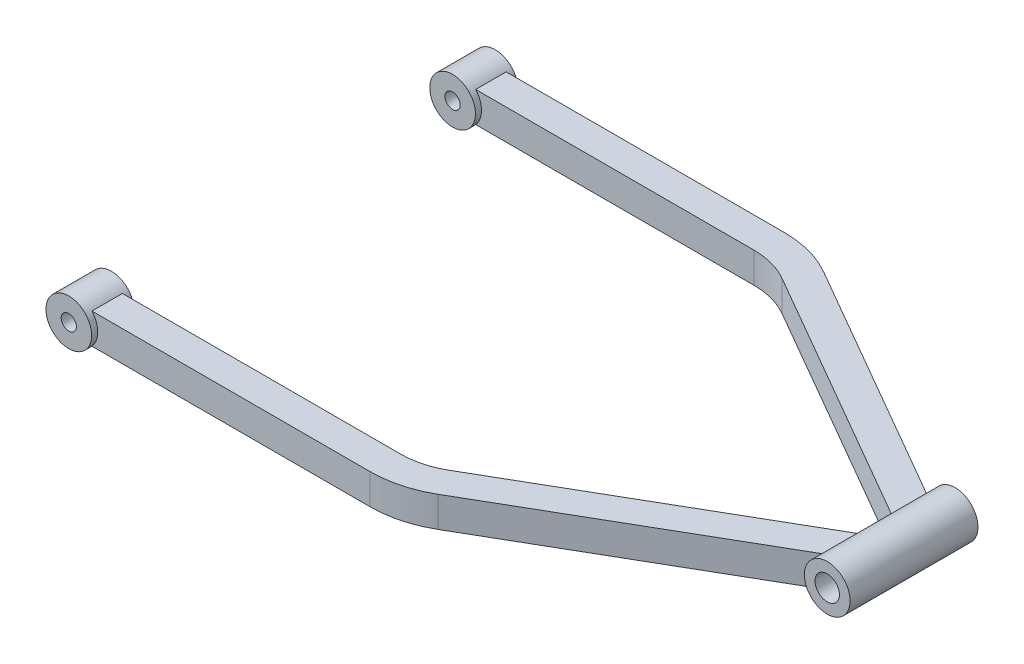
from build123d import *

# Parameters (mm, degrees)
SKETCH2_R               = 7.5
SKETCH2_R_2             = 2.5
BOSS_EXTRUDE1_DEPTH     = 7
SKETCH4_R               = 7.5
SKETCH4_R_2             = 4
BOSS_EXTRUDE2_DEPTH     = 21
SKETCH3_W               = 10
SKETCH3_H               = 10
CUT_EXTRUDE1_DEPTH      = 137
CUT_EXTRUDE1_DEPTH_BACK = 20
SKETCH2_2_R             = 2.5
SKETCH4_2_R             = 4
CUT_EXTRUDE2_DEPTH      = 30


with BuildPart() as part:
    # Sketch2 → Boss-Extrude1 (new, symmetric)
    with BuildSketch(Plane.XY.offset(-63)):
        Circle(SKETCH2_R)
        Circle(SKETCH2_R_2, mode=Mode.SUBTRACT)
    boss_extrude1 = extrude(amount=BOSS_EXTRUDE1_DEPTH, both=True)



with BuildPart() as body_2:
    # Sketch4 → Boss-Extrude2 (new, symmetric)
    with BuildSketch(Plane.XY):
        with Locations(Location((200, 0, 0), (0, 0, 180))):
            Circle(SKETCH4_R)
        with Locations(Location((200, 0, 0), (0, 0, 180))):
            Circle(SKETCH4_R_2, mode=Mode.SUBTRACT)
    extrude(amount=BOSS_EXTRUDE2_DEPTH, both=True)


with BuildPart() as part_1:
    add(part.part)

    add(body_2.part)  # Sweep1 merges body 2
    # Sweep1: sweep along a path in Sketch1
    with BuildLine(Plane(origin=(0, 0, 0), x_dir=(1, 0, 0), z_dir=(0, 1, 0))) as sweep1_path:
        Line((0, 63), (96.961524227, 63))
        ThreePointArc((96.961524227, 63), (104.72609558, 61.977774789), (111.961524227, 58.980762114))
        Line((111.961524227, 58.980762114), (200, 8.151724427))
    # Sketch3 → Sweep1 (sweep)
    with BuildSketch(Plane(origin=(0, 0, -63), x_dir=(0, 0, -1), z_dir=(1, 0, 0))):
        Rectangle(SKETCH3_W, SKETCH3_H)
    sweep1 = sweep(path=sweep1_path.line)

    # Mirror1: Boss-Extrude1, Sweep1 across plane
    add(boss_extrude1.mirror(Plane.XY))
    add(sweep1.mirror(Plane.XY))

    # Sketch2_2 → Cut-Extrude1 (cut, two sides: drawn at the far end of the back side and taken through both)
    with BuildSketch(Plane.XY.offset(-63).offset(-CUT_EXTRUDE1_DEPTH_BACK)):
        Circle(SKETCH2_2_R)
    extrude(amount=CUT_EXTRUDE1_DEPTH + CUT_EXTRUDE1_DEPTH_BACK, mode=Mode.SUBTRACT)

    # Sketch4_2 → Cut-Extrude2 (cut, symmetric)
    with BuildSketch(Plane.XY):
        with Locations(Location((200, 0, 0), (0, 0, 180))):
            Circle(SKETCH4_2_R)
    extrude(amount=CUT_EXTRUDE2_DEPTH, both=True, mode=Mode.SUBTRACT)


solid = part_1.part
